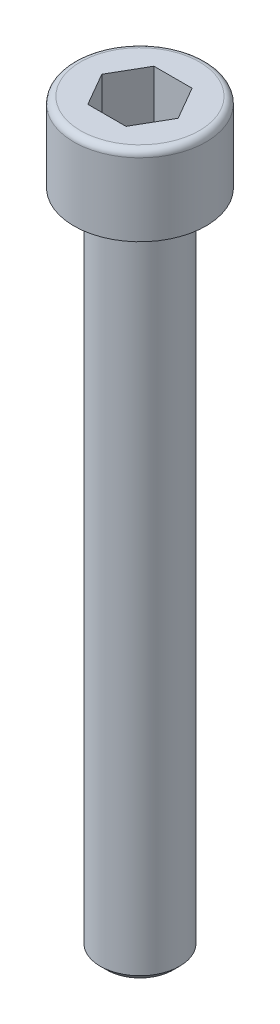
ISO-10303-21;
HEADER;
FILE_DESCRIPTION(('STEP AP214'),'2;1');
FILE_NAME('part.step','',(''),(''),'','','');
FILE_SCHEMA(('AUTOMOTIVE_DESIGN { 1 0 10303 214 1 1 1 1 }'));
ENDSEC;
DATA;
#1=APPLICATION_CONTEXT('core data for automotive mechanical design processes');
#2=APPLICATION_PROTOCOL_DEFINITION('international standard','automotive_design',2000,#1);
#3=PRODUCT_CONTEXT('',#1,'mechanical');
#4=PRODUCT('Part','Part','',(#3));
#5=PRODUCT_RELATED_PRODUCT_CATEGORY('part','',(#4));
#6=PRODUCT_DEFINITION_FORMATION('','',#4);
#7=PRODUCT_DEFINITION_CONTEXT('part definition',#1,'design');
#8=PRODUCT_DEFINITION('design','',#6,#7);
#9=PRODUCT_DEFINITION_SHAPE('','',#8);
#10=(LENGTH_UNIT() NAMED_UNIT(*) SI_UNIT(.MILLI.,.METRE.));
#11=(NAMED_UNIT(*) PLANE_ANGLE_UNIT() SI_UNIT($,.RADIAN.));
#12=(NAMED_UNIT(*) SI_UNIT($,.STERADIAN.) SOLID_ANGLE_UNIT());
#13=UNCERTAINTY_MEASURE_WITH_UNIT(LENGTH_MEASURE(1.E-05),#10,'distance_accuracy_value','');
#14=(GEOMETRIC_REPRESENTATION_CONTEXT(3) GLOBAL_UNCERTAINTY_ASSIGNED_CONTEXT((#13)) GLOBAL_UNIT_ASSIGNED_CONTEXT((#10,
#11,#12)) REPRESENTATION_CONTEXT('',''));
#15=CARTESIAN_POINT('',(0.,0.,0.));
#16=DIRECTION('',(0.,0.,1.));
#17=DIRECTION('',(1.,0.,0.));
#18=AXIS2_PLACEMENT_3D('',#15,#16,#17);
#19=CARTESIAN_POINT('',(-3.00000000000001,0.,0.));
#20=DIRECTION('',(0.,-1.,0.));
#21=DIRECTION('',(0.,0.,-1.));
#22=AXIS2_PLACEMENT_3D('',#19,#20,#21);
#23=PLANE('',#22);
#24=CARTESIAN_POINT('',(0.,0.,0.));
#25=DIRECTION('',(0.,-1.,0.));
#26=DIRECTION('',(0.,0.,-1.));
#27=AXIS2_PLACEMENT_3D('',#24,#25,#26);
#28=CIRCLE('',#27,2.5);
#29=CARTESIAN_POINT('',(0.,0.,-2.5));
#30=VERTEX_POINT('',#29);
#31=EDGE_CURVE('E11',#30,#30,#28,.T.);
#32=ORIENTED_EDGE('',*,*,#31,.T.);
#33=EDGE_LOOP('',(#32));
#34=FACE_BOUND('',#33,.T.);
#35=ADVANCED_FACE('F28',(#34),#23,.T.);
#36=CARTESIAN_POINT('',(0.,50.,0.));
#37=DIRECTION('',(0.,1.,0.));
#38=DIRECTION('',(0.,0.,1.));
#39=AXIS2_PLACEMENT_3D('',#36,#37,#38);
#40=CYLINDRICAL_SURFACE('',#39,3.);
#41=CARTESIAN_POINT('',(0.,0.500000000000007,0.));
#42=DIRECTION('',(0.,-1.,0.));
#43=DIRECTION('',(0.,0.,-1.));
#44=AXIS2_PLACEMENT_3D('',#41,#42,#43);
#45=CIRCLE('',#44,3.);
#46=CARTESIAN_POINT('',(0.,0.500000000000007,-3.));
#47=VERTEX_POINT('',#46);
#48=EDGE_CURVE('E35',#47,#47,#45,.F.);
#49=ORIENTED_EDGE('',*,*,#48,.T.);
#50=EDGE_LOOP('',(#49));
#51=FACE_BOUND('',#50,.T.);
#52=CARTESIAN_POINT('',(0.,50.,0.));
#53=DIRECTION('',(0.,1.,0.));
#54=DIRECTION('',(0.,0.,1.));
#55=AXIS2_PLACEMENT_3D('',#52,#53,#54);
#56=CIRCLE('',#55,3.);
#57=CARTESIAN_POINT('',(0.,50.,3.));
#58=VERTEX_POINT('',#57);
#59=EDGE_CURVE('E145',#58,#58,#56,.T.);
#60=ORIENTED_EDGE('',*,*,#59,.F.);
#61=EDGE_LOOP('',(#60));
#62=FACE_BOUND('',#61,.T.);
#63=ADVANCED_FACE('F150',(#51,#62),#40,.T.);
#64=CARTESIAN_POINT('',(-5.,50.,0.));
#65=DIRECTION('',(0.,-1.,0.));
#66=DIRECTION('',(0.,0.,-1.));
#67=AXIS2_PLACEMENT_3D('',#64,#65,#66);
#68=PLANE('',#67);
#69=ORIENTED_EDGE('',*,*,#59,.T.);
#70=EDGE_LOOP('',(#69));
#71=FACE_BOUND('',#70,.T.);
#72=CARTESIAN_POINT('',(0.,50.,0.));
#73=DIRECTION('',(0.,1.,0.));
#74=DIRECTION('',(0.,0.,1.));
#75=AXIS2_PLACEMENT_3D('',#72,#73,#74);
#76=CIRCLE('',#75,5.);
#77=CARTESIAN_POINT('',(0.,50.,5.));
#78=VERTEX_POINT('',#77);
#79=EDGE_CURVE('E142',#78,#78,#76,.T.);
#80=ORIENTED_EDGE('',*,*,#79,.F.);
#81=EDGE_LOOP('',(#80));
#82=FACE_BOUND('',#81,.T.);
#83=ADVANCED_FACE('F169',(#71,#82),#68,.T.);
#84=CARTESIAN_POINT('',(0.,50.,0.));
#85=DIRECTION('',(0.,1.,0.));
#86=DIRECTION('',(0.,0.,1.));
#87=AXIS2_PLACEMENT_3D('',#84,#85,#86);
#88=CYLINDRICAL_SURFACE('',#87,5.);
#89=ORIENTED_EDGE('',*,*,#79,.T.);
#90=EDGE_LOOP('',(#89));
#91=FACE_BOUND('',#90,.T.);
#92=CARTESIAN_POINT('',(0.,55.5,0.));
#93=DIRECTION('',(0.,1.,0.));
#94=DIRECTION('',(0.,0.,1.));
#95=AXIS2_PLACEMENT_3D('',#92,#93,#94);
#96=CIRCLE('',#95,5.);
#97=CARTESIAN_POINT('',(0.,55.5,5.));
#98=VERTEX_POINT('',#97);
#99=EDGE_CURVE('E139',#98,#98,#96,.T.);
#100=ORIENTED_EDGE('',*,*,#99,.F.);
#101=EDGE_LOOP('',(#100));
#102=FACE_BOUND('',#101,.T.);
#103=ADVANCED_FACE('F173',(#91,#102),#88,.T.);
#104=CARTESIAN_POINT('',(0.,55.5,0.));
#105=DIRECTION('',(0.,1.,0.));
#106=DIRECTION('',(0.,0.,1.));
#107=AXIS2_PLACEMENT_3D('',#104,#105,#106);
#108=TOROIDAL_SURFACE('',#107,4.5,0.5);
#109=CARTESIAN_POINT('',(0.,56.,0.));
#110=DIRECTION('',(0.,1.,0.));
#111=DIRECTION('',(0.,0.,1.));
#112=AXIS2_PLACEMENT_3D('',#109,#110,#111);
#113=CIRCLE('',#112,4.5);
#114=CARTESIAN_POINT('',(0.,56.,4.5));
#115=VERTEX_POINT('',#114);
#116=EDGE_CURVE('E130',#115,#115,#113,.T.);
#117=ORIENTED_EDGE('',*,*,#116,.F.);
#118=EDGE_LOOP('',(#117));
#119=FACE_BOUND('',#118,.T.);
#120=ORIENTED_EDGE('',*,*,#99,.T.);
#121=EDGE_LOOP('',(#120));
#122=FACE_BOUND('',#121,.T.);
#123=ADVANCED_FACE('F179',(#119,#122),#108,.T.);
#124=CARTESIAN_POINT('',(0.,56.,0.));
#125=DIRECTION('',(0.,1.,0.));
#126=DIRECTION('',(0.,0.,1.));
#127=AXIS2_PLACEMENT_3D('',#124,#125,#126);
#128=PLANE('',#127);
#129=DIRECTION('',(0.5,0.,0.866025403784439));
#130=VECTOR('',#129,1.);
#131=CARTESIAN_POINT('',(-2.88675134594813,56.,0.));
#132=LINE('',#131,#130);
#133=CARTESIAN_POINT('',(-2.88675134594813,56.,0.));
#134=VERTEX_POINT('',#133);
#135=CARTESIAN_POINT('',(-1.44337567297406,56.,2.5));
#136=VERTEX_POINT('',#135);
#137=EDGE_CURVE('E42',#134,#136,#132,.T.);
#138=ORIENTED_EDGE('',*,*,#137,.F.);
#139=DIRECTION('',(-0.5,0.,0.866025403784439));
#140=VECTOR('',#139,1.);
#141=CARTESIAN_POINT('',(-1.44337567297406,56.,-2.5));
#142=LINE('',#141,#140);
#143=CARTESIAN_POINT('',(-1.44337567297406,56.,-2.5));
#144=VERTEX_POINT('',#143);
#145=EDGE_CURVE('E112',#144,#134,#142,.T.);
#146=ORIENTED_EDGE('',*,*,#145,.F.);
#147=DIRECTION('',(-1.,0.,0.));
#148=VECTOR('',#147,1.);
#149=CARTESIAN_POINT('',(1.44337567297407,56.,-2.5));
#150=LINE('',#149,#148);
#151=CARTESIAN_POINT('',(1.44337567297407,56.,-2.5));
#152=VERTEX_POINT('',#151);
#153=EDGE_CURVE('E106',#152,#144,#150,.T.);
#154=ORIENTED_EDGE('',*,*,#153,.F.);
#155=DIRECTION('',(-0.5,0.,-0.866025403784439));
#156=VECTOR('',#155,1.);
#157=CARTESIAN_POINT('',(2.88675134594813,56.,0.));
#158=LINE('',#157,#156);
#159=CARTESIAN_POINT('',(2.88675134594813,56.,0.));
#160=VERTEX_POINT('',#159);
#161=EDGE_CURVE('E104',#160,#152,#158,.T.);
#162=ORIENTED_EDGE('',*,*,#161,.F.);
#163=DIRECTION('',(0.5,0.,-0.866025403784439));
#164=VECTOR('',#163,1.);
#165=CARTESIAN_POINT('',(1.44337567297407,56.,2.5));
#166=LINE('',#165,#164);
#167=CARTESIAN_POINT('',(1.44337567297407,56.,2.5));
#168=VERTEX_POINT('',#167);
#169=EDGE_CURVE('E85',#168,#160,#166,.T.);
#170=ORIENTED_EDGE('',*,*,#169,.F.);
#171=DIRECTION('',(1.,0.,0.));
#172=VECTOR('',#171,1.);
#173=CARTESIAN_POINT('',(-1.44337567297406,56.,2.5));
#174=LINE('',#173,#172);
#175=EDGE_CURVE('E96',#136,#168,#174,.T.);
#176=ORIENTED_EDGE('',*,*,#175,.F.);
#177=EDGE_LOOP('',(#138,#146,#154,#162,#170,#176));
#178=FACE_BOUND('',#177,.T.);
#179=ORIENTED_EDGE('',*,*,#116,.T.);
#180=EDGE_LOOP('',(#179));
#181=FACE_BOUND('',#180,.T.);
#182=ADVANCED_FACE('F100',(#178,#181),#128,.T.);
#183=CARTESIAN_POINT('',(-2.88675134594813,51.,0.));
#184=DIRECTION('',(-0.866025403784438,0.,0.5));
#185=DIRECTION('',(0.5,0.,0.866025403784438));
#186=AXIS2_PLACEMENT_3D('',#183,#184,#185);
#187=PLANE('',#186);
#188=ORIENTED_EDGE('',*,*,#137,.T.);
#189=DIRECTION('',(0.,1.,0.));
#190=VECTOR('',#189,1.);
#191=CARTESIAN_POINT('',(-1.44337567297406,51.,2.5));
#192=LINE('',#191,#190);
#193=CARTESIAN_POINT('',(-1.44337567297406,51.,2.5));
#194=VERTEX_POINT('',#193);
#195=EDGE_CURVE('E93',#194,#136,#192,.T.);
#196=ORIENTED_EDGE('',*,*,#195,.F.);
#197=DIRECTION('',(0.5,0.,0.866025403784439));
#198=VECTOR('',#197,1.);
#199=CARTESIAN_POINT('',(-2.88675134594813,51.,0.));
#200=LINE('',#199,#198);
#201=CARTESIAN_POINT('',(-2.88675134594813,51.,0.));
#202=VERTEX_POINT('',#201);
#203=EDGE_CURVE('E114',#202,#194,#200,.T.);
#204=ORIENTED_EDGE('',*,*,#203,.F.);
#205=DIRECTION('',(0.,1.,0.));
#206=VECTOR('',#205,1.);
#207=CARTESIAN_POINT('',(-2.88675134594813,51.,0.));
#208=LINE('',#207,#206);
#209=EDGE_CURVE('E49',#202,#134,#208,.T.);
#210=ORIENTED_EDGE('',*,*,#209,.T.);
#211=EDGE_LOOP('',(#188,#196,#204,#210));
#212=FACE_BOUND('',#211,.T.);
#213=ADVANCED_FACE('F186',(#212),#187,.F.);
#214=CARTESIAN_POINT('',(-1.44337567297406,51.,-2.5));
#215=DIRECTION('',(-0.866025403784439,0.,-0.5));
#216=DIRECTION('',(-0.5,0.,0.866025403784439));
#217=AXIS2_PLACEMENT_3D('',#214,#215,#216);
#218=PLANE('',#217);
#219=ORIENTED_EDGE('',*,*,#145,.T.);
#220=ORIENTED_EDGE('',*,*,#209,.F.);
#221=DIRECTION('',(-0.5,0.,0.866025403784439));
#222=VECTOR('',#221,1.);
#223=CARTESIAN_POINT('',(-1.44337567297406,51.,-2.5));
#224=LINE('',#223,#222);
#225=CARTESIAN_POINT('',(-1.44337567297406,51.,-2.5));
#226=VERTEX_POINT('',#225);
#227=EDGE_CURVE('E126',#226,#202,#224,.T.);
#228=ORIENTED_EDGE('',*,*,#227,.F.);
#229=DIRECTION('',(0.,1.,0.));
#230=VECTOR('',#229,1.);
#231=CARTESIAN_POINT('',(-1.44337567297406,51.,-2.5));
#232=LINE('',#231,#230);
#233=EDGE_CURVE('E131',#226,#144,#232,.T.);
#234=ORIENTED_EDGE('',*,*,#233,.T.);
#235=EDGE_LOOP('',(#219,#220,#228,#234));
#236=FACE_BOUND('',#235,.T.);
#237=ADVANCED_FACE('F189',(#236),#218,.F.);
#238=CARTESIAN_POINT('',(1.44337567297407,51.,-2.5));
#239=DIRECTION('',(0.,0.,-1.));
#240=DIRECTION('',(-1.,0.,0.));
#241=AXIS2_PLACEMENT_3D('',#238,#239,#240);
#242=PLANE('',#241);
#243=ORIENTED_EDGE('',*,*,#153,.T.);
#244=ORIENTED_EDGE('',*,*,#233,.F.);
#245=DIRECTION('',(-1.,0.,0.));
#246=VECTOR('',#245,1.);
#247=CARTESIAN_POINT('',(1.44337567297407,51.,-2.5));
#248=LINE('',#247,#246);
#249=CARTESIAN_POINT('',(1.44337567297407,51.,-2.5));
#250=VERTEX_POINT('',#249);
#251=EDGE_CURVE('E123',#250,#226,#248,.T.);
#252=ORIENTED_EDGE('',*,*,#251,.F.);
#253=DIRECTION('',(0.,1.,0.));
#254=VECTOR('',#253,1.);
#255=CARTESIAN_POINT('',(1.44337567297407,51.,-2.5));
#256=LINE('',#255,#254);
#257=EDGE_CURVE('E133',#250,#152,#256,.T.);
#258=ORIENTED_EDGE('',*,*,#257,.T.);
#259=EDGE_LOOP('',(#243,#244,#252,#258));
#260=FACE_BOUND('',#259,.T.);
#261=ADVANCED_FACE('F197',(#260),#242,.F.);
#262=CARTESIAN_POINT('',(2.88675134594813,51.,0.));
#263=DIRECTION('',(0.866025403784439,0.,-0.5));
#264=DIRECTION('',(-0.5,0.,-0.866025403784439));
#265=AXIS2_PLACEMENT_3D('',#262,#263,#264);
#266=PLANE('',#265);
#267=ORIENTED_EDGE('',*,*,#161,.T.);
#268=ORIENTED_EDGE('',*,*,#257,.F.);
#269=DIRECTION('',(-0.5,0.,-0.866025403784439));
#270=VECTOR('',#269,1.);
#271=CARTESIAN_POINT('',(2.88675134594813,51.,0.));
#272=LINE('',#271,#270);
#273=CARTESIAN_POINT('',(2.88675134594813,51.,0.));
#274=VERTEX_POINT('',#273);
#275=EDGE_CURVE('E120',#274,#250,#272,.T.);
#276=ORIENTED_EDGE('',*,*,#275,.F.);
#277=DIRECTION('',(0.,1.,0.));
#278=VECTOR('',#277,1.);
#279=CARTESIAN_POINT('',(2.88675134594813,51.,0.));
#280=LINE('',#279,#278);
#281=EDGE_CURVE('E92',#274,#160,#280,.T.);
#282=ORIENTED_EDGE('',*,*,#281,.T.);
#283=EDGE_LOOP('',(#267,#268,#276,#282));
#284=FACE_BOUND('',#283,.T.);
#285=ADVANCED_FACE('F194',(#284),#266,.F.);
#286=CARTESIAN_POINT('',(1.44337567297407,51.,2.5));
#287=DIRECTION('',(0.866025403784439,0.,0.5));
#288=DIRECTION('',(0.5,0.,-0.866025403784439));
#289=AXIS2_PLACEMENT_3D('',#286,#287,#288);
#290=PLANE('',#289);
#291=ORIENTED_EDGE('',*,*,#169,.T.);
#292=ORIENTED_EDGE('',*,*,#281,.F.);
#293=DIRECTION('',(0.5,0.,-0.866025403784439));
#294=VECTOR('',#293,1.);
#295=CARTESIAN_POINT('',(1.44337567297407,51.,2.5));
#296=LINE('',#295,#294);
#297=CARTESIAN_POINT('',(1.44337567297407,51.,2.5));
#298=VERTEX_POINT('',#297);
#299=EDGE_CURVE('E88',#298,#274,#296,.T.);
#300=ORIENTED_EDGE('',*,*,#299,.F.);
#301=DIRECTION('',(0.,1.,0.));
#302=VECTOR('',#301,1.);
#303=CARTESIAN_POINT('',(1.44337567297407,51.,2.5));
#304=LINE('',#303,#302);
#305=EDGE_CURVE('E81',#298,#168,#304,.T.);
#306=ORIENTED_EDGE('',*,*,#305,.T.);
#307=EDGE_LOOP('',(#291,#292,#300,#306));
#308=FACE_BOUND('',#307,.T.);
#309=ADVANCED_FACE('F83',(#308),#290,.F.);
#310=CARTESIAN_POINT('',(-1.44337567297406,51.,2.5));
#311=DIRECTION('',(0.,0.,1.));
#312=DIRECTION('',(1.,0.,0.));
#313=AXIS2_PLACEMENT_3D('',#310,#311,#312);
#314=PLANE('',#313);
#315=ORIENTED_EDGE('',*,*,#175,.T.);
#316=ORIENTED_EDGE('',*,*,#305,.F.);
#317=DIRECTION('',(1.,0.,0.));
#318=VECTOR('',#317,1.);
#319=CARTESIAN_POINT('',(-1.44337567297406,51.,2.5));
#320=LINE('',#319,#318);
#321=EDGE_CURVE('E117',#194,#298,#320,.T.);
#322=ORIENTED_EDGE('',*,*,#321,.F.);
#323=ORIENTED_EDGE('',*,*,#195,.T.);
#324=EDGE_LOOP('',(#315,#316,#322,#323));
#325=FACE_BOUND('',#324,.T.);
#326=ADVANCED_FACE('F97',(#325),#314,.F.);
#327=CARTESIAN_POINT('',(-2.88675134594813,51.,0.));
#328=DIRECTION('',(0.,-1.,0.));
#329=DIRECTION('',(0.,0.,-1.));
#330=AXIS2_PLACEMENT_3D('',#327,#328,#329);
#331=PLANE('',#330);
#332=ORIENTED_EDGE('',*,*,#203,.T.);
#333=ORIENTED_EDGE('',*,*,#321,.T.);
#334=ORIENTED_EDGE('',*,*,#299,.T.);
#335=ORIENTED_EDGE('',*,*,#275,.T.);
#336=ORIENTED_EDGE('',*,*,#251,.T.);
#337=ORIENTED_EDGE('',*,*,#227,.T.);
#338=EDGE_LOOP('',(#332,#333,#334,#335,#336,#337));
#339=FACE_BOUND('',#338,.T.);
#340=ADVANCED_FACE('F155',(#339),#331,.F.);
#341=CARTESIAN_POINT('',(0.,0.500000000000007,0.));
#342=DIRECTION('',(0.,1.,0.));
#343=DIRECTION('',(0.,0.,1.));
#344=AXIS2_PLACEMENT_3D('',#341,#342,#343);
#345=CONICAL_SURFACE('',#344,3.,0.785398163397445);
#346=ORIENTED_EDGE('',*,*,#31,.F.);
#347=EDGE_LOOP('',(#346));
#348=FACE_BOUND('',#347,.T.);
#349=ORIENTED_EDGE('',*,*,#48,.F.);
#350=EDGE_LOOP('',(#349));
#351=FACE_BOUND('',#350,.T.);
#352=ADVANCED_FACE('F153',(#348,#351),#345,.T.);
#353=CLOSED_SHELL('',(#35,#63,#83,#103,#123,#182,#213,#237,#261,#285,#309,#326,#340,#352));
#354=MANIFOLD_SOLID_BREP('B2',#353);
#355=ADVANCED_BREP_SHAPE_REPRESENTATION('',(#18,#354),#14);
#356=SHAPE_DEFINITION_REPRESENTATION(#9,#355);
ENDSEC;
END-ISO-10303-21;
